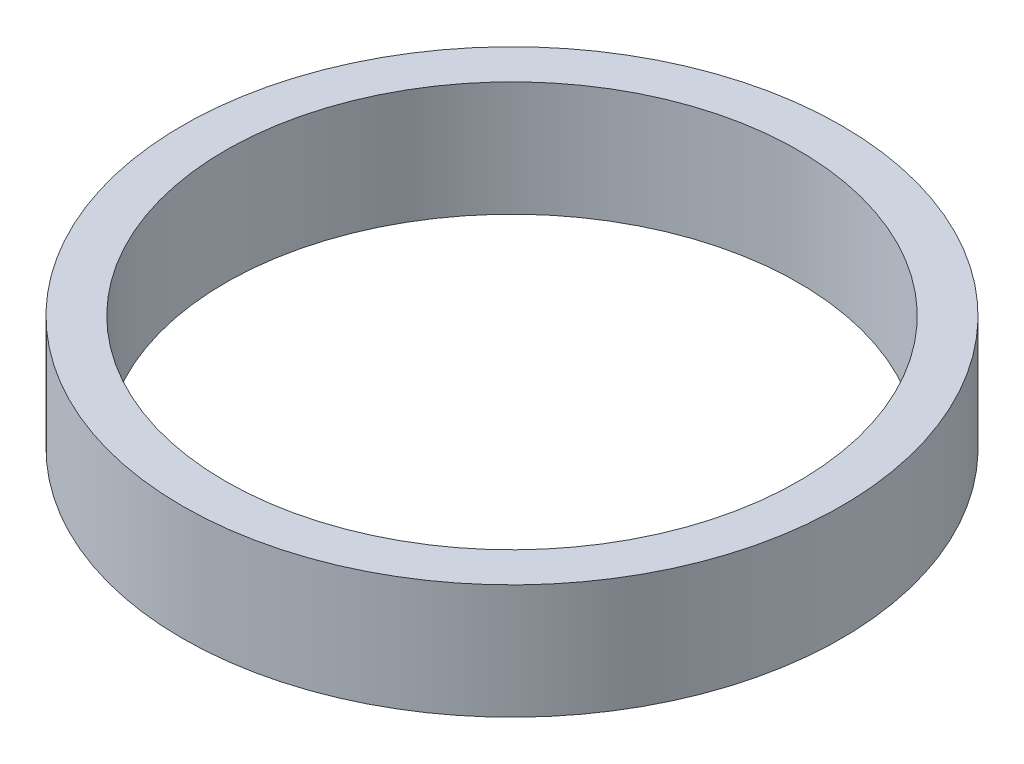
ISO-10303-21;
HEADER;
FILE_DESCRIPTION(('STEP AP214'),'2;1');
FILE_NAME('part.step','',(''),(''),'','','');
FILE_SCHEMA(('AUTOMOTIVE_DESIGN { 1 0 10303 214 1 1 1 1 }'));
ENDSEC;
DATA;
#1=APPLICATION_CONTEXT('core data for automotive mechanical design processes');
#2=APPLICATION_PROTOCOL_DEFINITION('international standard','automotive_design',2000,#1);
#3=PRODUCT_CONTEXT('',#1,'mechanical');
#4=PRODUCT('Part','Part','',(#3));
#5=PRODUCT_RELATED_PRODUCT_CATEGORY('part','',(#4));
#6=PRODUCT_DEFINITION_FORMATION('','',#4);
#7=PRODUCT_DEFINITION_CONTEXT('part definition',#1,'design');
#8=PRODUCT_DEFINITION('design','',#6,#7);
#9=PRODUCT_DEFINITION_SHAPE('','',#8);
#10=(LENGTH_UNIT() NAMED_UNIT(*) SI_UNIT(.MILLI.,.METRE.));
#11=(NAMED_UNIT(*) PLANE_ANGLE_UNIT() SI_UNIT($,.RADIAN.));
#12=(NAMED_UNIT(*) SI_UNIT($,.STERADIAN.) SOLID_ANGLE_UNIT());
#13=UNCERTAINTY_MEASURE_WITH_UNIT(LENGTH_MEASURE(1.E-05),#10,'distance_accuracy_value','');
#14=(GEOMETRIC_REPRESENTATION_CONTEXT(3) GLOBAL_UNCERTAINTY_ASSIGNED_CONTEXT((#13)) GLOBAL_UNIT_ASSIGNED_CONTEXT((#10,
#11,#12)) REPRESENTATION_CONTEXT('',''));
#15=CARTESIAN_POINT('',(0.,0.,0.));
#16=DIRECTION('',(0.,0.,1.));
#17=DIRECTION('',(1.,0.,0.));
#18=AXIS2_PLACEMENT_3D('',#15,#16,#17);
#19=CARTESIAN_POINT('',(0.,4.,0.));
#20=DIRECTION('',(0.,1.,0.));
#21=DIRECTION('',(0.,0.,1.));
#22=AXIS2_PLACEMENT_3D('',#19,#20,#21);
#23=PLANE('',#22);
#24=CARTESIAN_POINT('',(0.,4.,0.));
#25=DIRECTION('',(0.,1.,0.));
#26=DIRECTION('',(0.,0.,1.));
#27=AXIS2_PLACEMENT_3D('',#24,#25,#26);
#28=CIRCLE('',#27,11.5);
#29=CARTESIAN_POINT('',(0.,4.,11.5));
#30=VERTEX_POINT('',#29);
#31=EDGE_CURVE('E10',#30,#30,#28,.T.);
#32=ORIENTED_EDGE('',*,*,#31,.T.);
#33=EDGE_LOOP('',(#32));
#34=FACE_BOUND('',#33,.T.);
#35=CARTESIAN_POINT('',(0.,4.,0.));
#36=DIRECTION('',(0.,1.,0.));
#37=DIRECTION('',(0.,0.,1.));
#38=AXIS2_PLACEMENT_3D('',#35,#36,#37);
#39=CIRCLE('',#38,10.);
#40=CARTESIAN_POINT('',(0.,4.,10.));
#41=VERTEX_POINT('',#40);
#42=EDGE_CURVE('E44',#41,#41,#39,.T.);
#43=ORIENTED_EDGE('',*,*,#42,.F.);
#44=EDGE_LOOP('',(#43));
#45=FACE_BOUND('',#44,.T.);
#46=ADVANCED_FACE('F33',(#34,#45),#23,.T.);
#47=CARTESIAN_POINT('',(0.,0.,0.));
#48=DIRECTION('',(0.,1.,0.));
#49=DIRECTION('',(0.,0.,1.));
#50=AXIS2_PLACEMENT_3D('',#47,#48,#49);
#51=PLANE('',#50);
#52=CARTESIAN_POINT('',(0.,0.,0.));
#53=DIRECTION('',(0.,1.,0.));
#54=DIRECTION('',(0.,0.,1.));
#55=AXIS2_PLACEMENT_3D('',#52,#53,#54);
#56=CIRCLE('',#55,11.5);
#57=CARTESIAN_POINT('',(0.,0.,11.5));
#58=VERTEX_POINT('',#57);
#59=EDGE_CURVE('E37',#58,#58,#56,.T.);
#60=ORIENTED_EDGE('',*,*,#59,.F.);
#61=EDGE_LOOP('',(#60));
#62=FACE_BOUND('',#61,.T.);
#63=CARTESIAN_POINT('',(0.,0.,0.));
#64=DIRECTION('',(0.,1.,0.));
#65=DIRECTION('',(0.,0.,1.));
#66=AXIS2_PLACEMENT_3D('',#63,#64,#65);
#67=CIRCLE('',#66,10.);
#68=CARTESIAN_POINT('',(0.,0.,10.));
#69=VERTEX_POINT('',#68);
#70=EDGE_CURVE('E46',#69,#69,#67,.T.);
#71=ORIENTED_EDGE('',*,*,#70,.T.);
#72=EDGE_LOOP('',(#71));
#73=FACE_BOUND('',#72,.T.);
#74=ADVANCED_FACE('F56',(#62,#73),#51,.F.);
#75=CARTESIAN_POINT('',(0.,4.,0.));
#76=DIRECTION('',(0.,-1.,0.));
#77=DIRECTION('',(0.,0.,-1.));
#78=AXIS2_PLACEMENT_3D('',#75,#76,#77);
#79=CYLINDRICAL_SURFACE('',#78,11.5);
#80=ORIENTED_EDGE('',*,*,#31,.F.);
#81=EDGE_LOOP('',(#80));
#82=FACE_BOUND('',#81,.T.);
#83=ORIENTED_EDGE('',*,*,#59,.T.);
#84=EDGE_LOOP('',(#83));
#85=FACE_BOUND('',#84,.T.);
#86=ADVANCED_FACE('F35',(#82,#85),#79,.T.);
#87=CARTESIAN_POINT('',(0.,4.,0.));
#88=DIRECTION('',(0.,-1.,0.));
#89=DIRECTION('',(0.,0.,-1.));
#90=AXIS2_PLACEMENT_3D('',#87,#88,#89);
#91=CYLINDRICAL_SURFACE('',#90,10.);
#92=ORIENTED_EDGE('',*,*,#42,.T.);
#93=EDGE_LOOP('',(#92));
#94=FACE_BOUND('',#93,.T.);
#95=ORIENTED_EDGE('',*,*,#70,.F.);
#96=EDGE_LOOP('',(#95));
#97=FACE_BOUND('',#96,.T.);
#98=ADVANCED_FACE('F52',(#94,#97),#91,.F.);
#99=CLOSED_SHELL('',(#46,#74,#86,#98));
#100=MANIFOLD_SOLID_BREP('B2',#99);
#101=ADVANCED_BREP_SHAPE_REPRESENTATION('',(#18,#100),#14);
#102=SHAPE_DEFINITION_REPRESENTATION(#9,#101);
ENDSEC;
END-ISO-10303-21;
